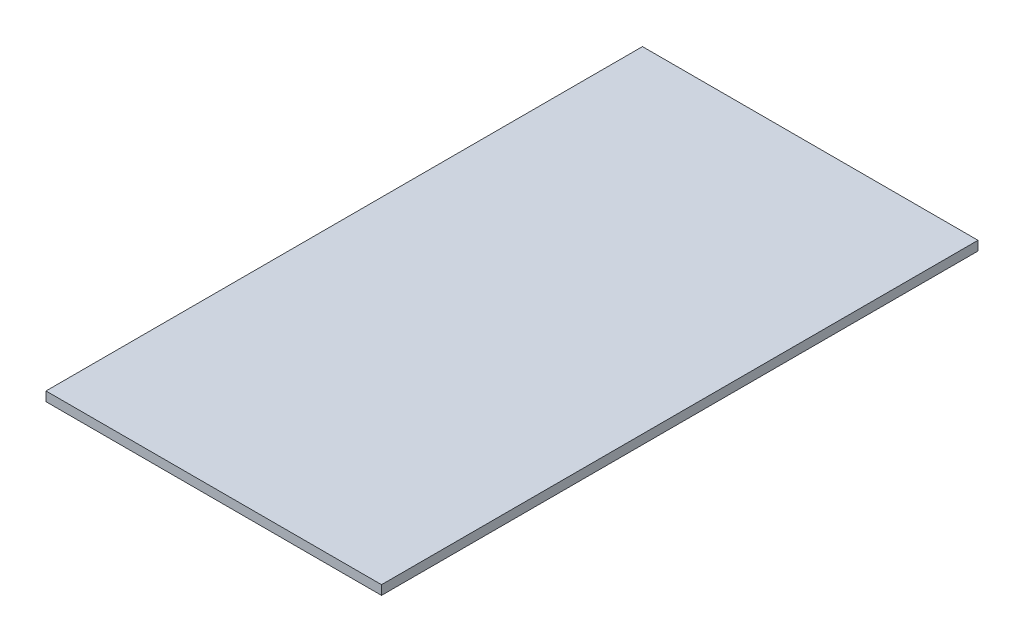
from build123d import *

# Parameters (mm, degrees)
SKETCH1_W      = 685.8
SKETCH1_H      = 1219.2
EXTRUDE1_DEPTH = 19.05


with BuildPart() as part:
    # Sketch1 → Extrude1 (new body)
    with BuildSketch(Plane(origin=(0, 0, 0), x_dir=(1, 0, 0), z_dir=(0, 1, 0))):
        with Locations((342.9, 609.6)):
            Rectangle(SKETCH1_W, SKETCH1_H)
    extrude(amount=EXTRUDE1_DEPTH)


solid = part.part
